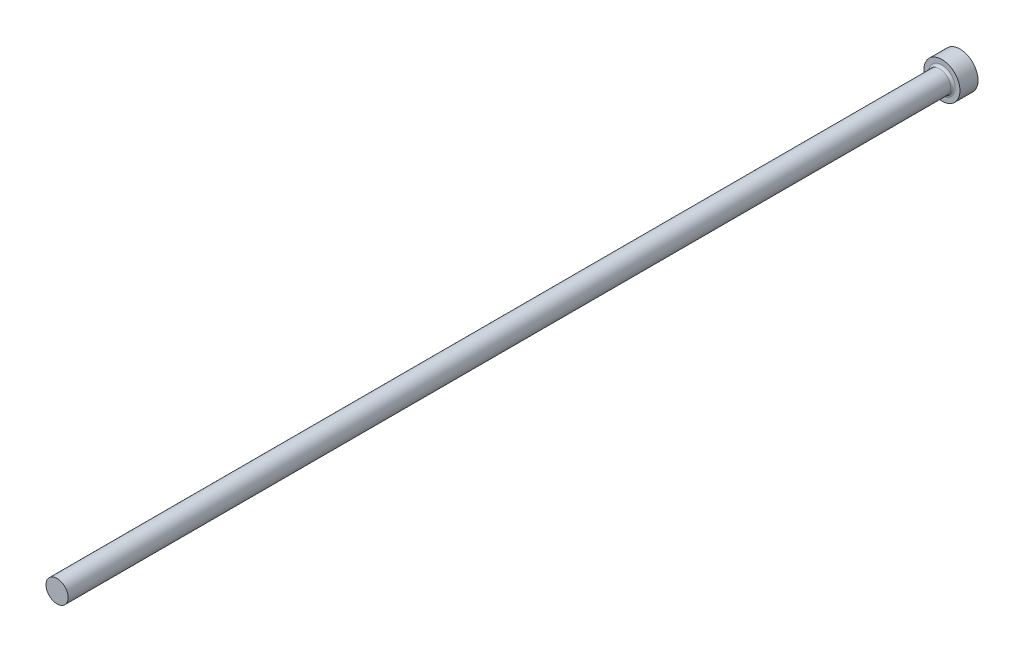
ISO-10303-21;
HEADER;
FILE_DESCRIPTION(('STEP AP214'),'2;1');
FILE_NAME('part.step','',(''),(''),'','','');
FILE_SCHEMA(('AUTOMOTIVE_DESIGN { 1 0 10303 214 1 1 1 1 }'));
ENDSEC;
DATA;
#1=APPLICATION_CONTEXT('core data for automotive mechanical design processes');
#2=APPLICATION_PROTOCOL_DEFINITION('international standard','automotive_design',2000,#1);
#3=PRODUCT_CONTEXT('',#1,'mechanical');
#4=PRODUCT('Part','Part','',(#3));
#5=PRODUCT_RELATED_PRODUCT_CATEGORY('part','',(#4));
#6=PRODUCT_DEFINITION_FORMATION('','',#4);
#7=PRODUCT_DEFINITION_CONTEXT('part definition',#1,'design');
#8=PRODUCT_DEFINITION('design','',#6,#7);
#9=PRODUCT_DEFINITION_SHAPE('','',#8);
#10=(LENGTH_UNIT() NAMED_UNIT(*) SI_UNIT(.MILLI.,.METRE.));
#11=(NAMED_UNIT(*) PLANE_ANGLE_UNIT() SI_UNIT($,.RADIAN.));
#12=(NAMED_UNIT(*) SI_UNIT($,.STERADIAN.) SOLID_ANGLE_UNIT());
#13=UNCERTAINTY_MEASURE_WITH_UNIT(LENGTH_MEASURE(1.E-05),#10,'distance_accuracy_value','');
#14=(GEOMETRIC_REPRESENTATION_CONTEXT(3) GLOBAL_UNCERTAINTY_ASSIGNED_CONTEXT((#13)) GLOBAL_UNIT_ASSIGNED_CONTEXT((#10,
#11,#12)) REPRESENTATION_CONTEXT('',''));
#15=CARTESIAN_POINT('',(0.,0.,0.));
#16=DIRECTION('',(0.,0.,1.));
#17=DIRECTION('',(1.,0.,0.));
#18=AXIS2_PLACEMENT_3D('',#15,#16,#17);
#19=CARTESIAN_POINT('',(4.,0.,4.));
#20=DIRECTION('',(0.,0.,-1.));
#21=DIRECTION('',(-1.,0.,0.));
#22=AXIS2_PLACEMENT_3D('',#19,#20,#21);
#23=PLANE('',#22);
#24=CARTESIAN_POINT('',(0.,0.,4.));
#25=DIRECTION('',(0.,0.,-1.));
#26=DIRECTION('',(-1.,0.,0.));
#27=AXIS2_PLACEMENT_3D('',#24,#25,#26);
#28=CIRCLE('',#27,2.95000000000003);
#29=CARTESIAN_POINT('',(-2.95000000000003,0.,4.));
#30=VERTEX_POINT('',#29);
#31=EDGE_CURVE('E40',#30,#30,#28,.T.);
#32=ORIENTED_EDGE('',*,*,#31,.T.);
#33=EDGE_LOOP('',(#32));
#34=FACE_BOUND('',#33,.T.);
#35=CARTESIAN_POINT('',(0.,0.,4.));
#36=DIRECTION('',(0.,0.,-1.));
#37=DIRECTION('',(-1.,0.,0.));
#38=AXIS2_PLACEMENT_3D('',#35,#36,#37);
#39=CIRCLE('',#38,4.);
#40=CARTESIAN_POINT('',(-4.,0.,4.));
#41=VERTEX_POINT('',#40);
#42=EDGE_CURVE('E44',#41,#41,#39,.T.);
#43=ORIENTED_EDGE('',*,*,#42,.F.);
#44=EDGE_LOOP('',(#43));
#45=FACE_BOUND('',#44,.T.);
#46=ADVANCED_FACE('F33',(#34,#45),#23,.F.);
#47=CARTESIAN_POINT('',(0.,0.,-9.03322817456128));
#48=DIRECTION('',(0.,0.,-1.));
#49=DIRECTION('',(-1.,0.,0.));
#50=AXIS2_PLACEMENT_3D('',#47,#48,#49);
#51=CYLINDRICAL_SURFACE('',#50,4.);
#52=CARTESIAN_POINT('',(0.,0.,0.));
#53=DIRECTION('',(0.,0.,-1.));
#54=DIRECTION('',(-1.,0.,0.));
#55=AXIS2_PLACEMENT_3D('',#52,#53,#54);
#56=CIRCLE('',#55,4.);
#57=CARTESIAN_POINT('',(-4.,0.,0.));
#58=VERTEX_POINT('',#57);
#59=EDGE_CURVE('E48',#58,#58,#56,.T.);
#60=ORIENTED_EDGE('',*,*,#59,.F.);
#61=EDGE_LOOP('',(#60));
#62=FACE_BOUND('',#61,.T.);
#63=ORIENTED_EDGE('',*,*,#42,.T.);
#64=EDGE_LOOP('',(#63));
#65=FACE_BOUND('',#64,.T.);
#66=ADVANCED_FACE('F68',(#62,#65),#51,.T.);
#67=CARTESIAN_POINT('',(0.,0.,0.));
#68=DIRECTION('',(0.,0.,1.));
#69=DIRECTION('',(1.,0.,0.));
#70=AXIS2_PLACEMENT_3D('',#67,#68,#69);
#71=PLANE('',#70);
#72=ORIENTED_EDGE('',*,*,#59,.T.);
#73=EDGE_LOOP('',(#72));
#74=FACE_BOUND('',#73,.T.);
#75=ADVANCED_FACE('F61',(#74),#71,.F.);
#76=CARTESIAN_POINT('',(0.,0.,200.));
#77=DIRECTION('',(0.,0.,-1.));
#78=DIRECTION('',(-1.,0.,0.));
#79=AXIS2_PLACEMENT_3D('',#76,#77,#78);
#80=PLANE('',#79);
#81=CARTESIAN_POINT('',(0.,0.,200.));
#82=DIRECTION('',(0.,0.,-1.));
#83=DIRECTION('',(-1.,0.,0.));
#84=AXIS2_PLACEMENT_3D('',#81,#82,#83);
#85=CIRCLE('',#84,2.45000000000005);
#86=CARTESIAN_POINT('',(-2.45000000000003,0.,200.));
#87=VERTEX_POINT('',#86);
#88=EDGE_CURVE('E53',#87,#87,#85,.T.);
#89=ORIENTED_EDGE('',*,*,#88,.F.);
#90=EDGE_LOOP('',(#89));
#91=FACE_BOUND('',#90,.T.);
#92=ADVANCED_FACE('F59',(#91),#80,.F.);
#93=CARTESIAN_POINT('',(0.,0.,-9.03322817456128));
#94=DIRECTION('',(0.,0.,-1.));
#95=DIRECTION('',(-1.,0.,0.));
#96=AXIS2_PLACEMENT_3D('',#93,#94,#95);
#97=CYLINDRICAL_SURFACE('',#96,2.45000000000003);
#98=CARTESIAN_POINT('',(0.,0.,4.5));
#99=DIRECTION('',(0.,0.,-1.));
#100=DIRECTION('',(-1.,0.,0.));
#101=AXIS2_PLACEMENT_3D('',#98,#99,#100);
#102=CIRCLE('',#101,2.45000000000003);
#103=CARTESIAN_POINT('',(-2.45000000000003,0.,4.5));
#104=VERTEX_POINT('',#103);
#105=EDGE_CURVE('E10',#104,#104,#102,.F.);
#106=ORIENTED_EDGE('',*,*,#105,.T.);
#107=EDGE_LOOP('',(#106));
#108=FACE_BOUND('',#107,.T.);
#109=ORIENTED_EDGE('',*,*,#88,.T.);
#110=EDGE_LOOP('',(#109));
#111=FACE_BOUND('',#110,.T.);
#112=ADVANCED_FACE('F57',(#108,#111),#97,.T.);
#113=CARTESIAN_POINT('',(0.,0.,4.5));
#114=DIRECTION('',(0.,0.,-1.));
#115=DIRECTION('',(-1.,0.,0.));
#116=AXIS2_PLACEMENT_3D('',#113,#114,#115);
#117=TOROIDAL_SURFACE('',#116,2.95000000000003,0.5);
#118=ORIENTED_EDGE('',*,*,#105,.F.);
#119=EDGE_LOOP('',(#118));
#120=FACE_BOUND('',#119,.T.);
#121=ORIENTED_EDGE('',*,*,#31,.F.);
#122=EDGE_LOOP('',(#121));
#123=FACE_BOUND('',#122,.T.);
#124=ADVANCED_FACE('F35',(#120,#123),#117,.F.);
#125=CLOSED_SHELL('',(#46,#66,#75,#92,#112,#124));
#126=MANIFOLD_SOLID_BREP('B2',#125);
#127=ADVANCED_BREP_SHAPE_REPRESENTATION('',(#18,#126),#14);
#128=SHAPE_DEFINITION_REPRESENTATION(#9,#127);
ENDSEC;
END-ISO-10303-21;
